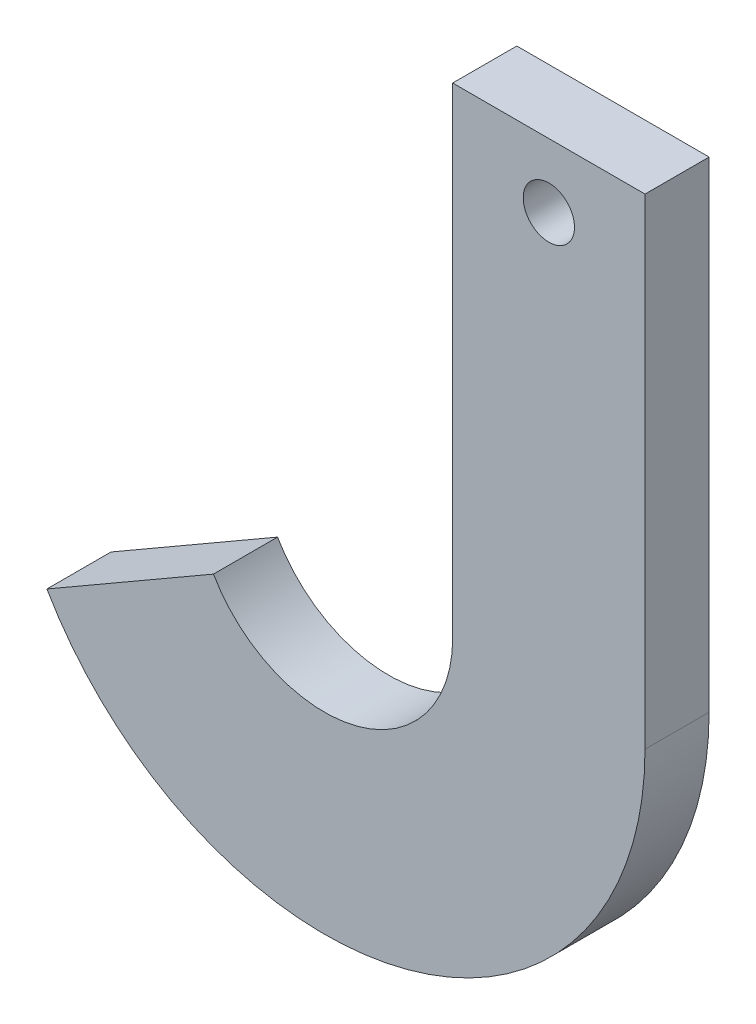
from build123d import *

# Parameters (mm, degrees)
EXTRUDE1_DEPTH = 20
SKETCH2_R      = 8
EXTRUDE3_DEPTH = 182.383571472


with BuildPart() as part:
    # Sketch1 → Extrude1 (new body)
    with BuildSketch(Plane.XY):
        with BuildLine():
            Line((-34.641016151, -20), (-86.602540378, -50))
            ThreePointArc((-86.602540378, -50), (25.88190451, -96.592582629), (100, 0))
            Line((100, 0), (100, 150))
            Line((100, 150), (40, 150))
            Line((40, 150), (40, 0))
            ThreePointArc((40, 0), (10.352761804, -38.637033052), (-34.641016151, -20))
        make_face()
    extrude(amount=EXTRUDE1_DEPTH)

    # Sketch2 → Extrude3 (cut, through all)
    with BuildSketch(Plane.XY):
        with Locations((70, 130)):
            Circle(SKETCH2_R)
    extrude(amount=EXTRUDE3_DEPTH, mode=Mode.SUBTRACT)


solid = part.part
